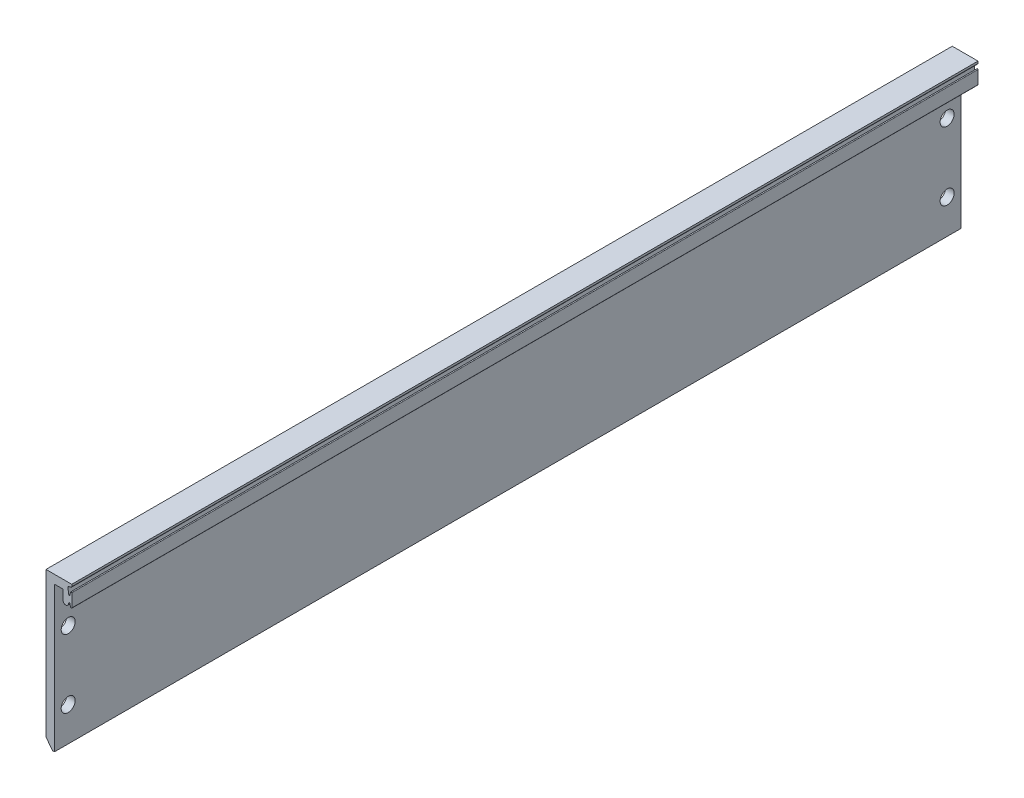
ISO-10303-21;
HEADER;
FILE_DESCRIPTION(('STEP AP214'),'2;1');
FILE_NAME('part.step','',(''),(''),'','','');
FILE_SCHEMA(('AUTOMOTIVE_DESIGN { 1 0 10303 214 1 1 1 1 }'));
ENDSEC;
DATA;
#1=APPLICATION_CONTEXT('core data for automotive mechanical design processes');
#2=APPLICATION_PROTOCOL_DEFINITION('international standard','automotive_design',2000,#1);
#3=PRODUCT_CONTEXT('',#1,'mechanical');
#4=PRODUCT('Part','Part','',(#3));
#5=PRODUCT_RELATED_PRODUCT_CATEGORY('part','',(#4));
#6=PRODUCT_DEFINITION_FORMATION('','',#4);
#7=PRODUCT_DEFINITION_CONTEXT('part definition',#1,'design');
#8=PRODUCT_DEFINITION('design','',#6,#7);
#9=PRODUCT_DEFINITION_SHAPE('','',#8);
#10=(LENGTH_UNIT() NAMED_UNIT(*) SI_UNIT(.MILLI.,.METRE.));
#11=(NAMED_UNIT(*) PLANE_ANGLE_UNIT() SI_UNIT($,.RADIAN.));
#12=(NAMED_UNIT(*) SI_UNIT($,.STERADIAN.) SOLID_ANGLE_UNIT());
#13=UNCERTAINTY_MEASURE_WITH_UNIT(LENGTH_MEASURE(1.E-05),#10,'distance_accuracy_value','');
#14=(GEOMETRIC_REPRESENTATION_CONTEXT(3) GLOBAL_UNCERTAINTY_ASSIGNED_CONTEXT((#13)) GLOBAL_UNIT_ASSIGNED_CONTEXT((#10,
#11,#12)) REPRESENTATION_CONTEXT('',''));
#15=CARTESIAN_POINT('',(0.,0.,0.));
#16=DIRECTION('',(0.,0.,1.));
#17=DIRECTION('',(1.,0.,0.));
#18=AXIS2_PLACEMENT_3D('',#15,#16,#17);
#19=CARTESIAN_POINT('',(540.829442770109,-3340.4171465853,132.675000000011));
#20=DIRECTION('',(-0.159823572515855,0.987145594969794,0.));
#21=DIRECTION('',(-0.987145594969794,-0.159823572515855,0.));
#22=AXIS2_PLACEMENT_3D('',#19,#20,#21);
#23=PLANE('',#22);
#24=DIRECTION('',(0.987145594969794,0.159823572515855,0.));
#25=VECTOR('',#24,1.);
#26=CARTESIAN_POINT('',(540.829442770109,-3340.4171465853,-132.674999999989));
#27=LINE('',#26,#25);
#28=CARTESIAN_POINT('',(2261.93990029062,-3061.76116775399,-132.67499999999));
#29=VERTEX_POINT('',#28);
#30=CARTESIAN_POINT('',(2262.48897943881,-3061.67226922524,-132.67499999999));
#31=VERTEX_POINT('',#30);
#32=EDGE_CURVE('E228',#29,#31,#27,.T.);
#33=ORIENTED_EDGE('',*,*,#32,.T.);
#34=DIRECTION('',(0.,0.,-1.));
#35=VECTOR('',#34,1.);
#36=CARTESIAN_POINT('',(2262.48897943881,-3061.67226922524,132.675000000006));
#37=LINE('',#36,#35);
#38=CARTESIAN_POINT('',(2262.48897943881,-3061.67226922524,132.675000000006));
#39=VERTEX_POINT('',#38);
#40=EDGE_CURVE('E13',#39,#31,#37,.T.);
#41=ORIENTED_EDGE('',*,*,#40,.F.);
#42=DIRECTION('',(0.987145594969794,0.159823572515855,0.));
#43=VECTOR('',#42,1.);
#44=CARTESIAN_POINT('',(540.829442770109,-3340.4171465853,132.675000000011));
#45=LINE('',#44,#43);
#46=CARTESIAN_POINT('',(2261.93990029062,-3061.76116775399,132.675000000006));
#47=VERTEX_POINT('',#46);
#48=EDGE_CURVE('E276',#47,#39,#45,.T.);
#49=ORIENTED_EDGE('',*,*,#48,.F.);
#50=DIRECTION('',(0.,0.,-1.));
#51=VECTOR('',#50,1.);
#52=CARTESIAN_POINT('',(2261.93990029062,-3061.76116775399,132.675000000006));
#53=LINE('',#52,#51);
#54=EDGE_CURVE('E70',#47,#29,#53,.T.);
#55=ORIENTED_EDGE('',*,*,#54,.T.);
#56=EDGE_LOOP('',(#33,#41,#49,#55));
#57=FACE_BOUND('',#56,.T.);
#58=ADVANCED_FACE('F52',(#57),#23,.F.);
#59=CARTESIAN_POINT('',(2262.44103236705,-3061.37612554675,132.675000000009));
#60=DIRECTION('',(0.,0.,-1.));
#61=DIRECTION('',(-1.,0.,0.));
#62=AXIS2_PLACEMENT_3D('',#59,#60,#61);
#63=CYLINDRICAL_SURFACE('',#62,0.300000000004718);
#64=CARTESIAN_POINT('',(2262.44103236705,-3061.37612554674,-132.67499999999));
#65=DIRECTION('',(0.,0.,1.));
#66=DIRECTION('',(1.,0.,0.));
#67=AXIS2_PLACEMENT_3D('',#64,#65,#66);
#68=CIRCLE('',#67,0.300000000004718);
#69=CARTESIAN_POINT('',(2262.74103236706,-3061.37612554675,-132.67499999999));
#70=VERTEX_POINT('',#69);
#71=EDGE_CURVE('E230',#31,#70,#68,.T.);
#72=ORIENTED_EDGE('',*,*,#71,.T.);
#73=DIRECTION('',(0.,0.,-1.));
#74=VECTOR('',#73,1.);
#75=CARTESIAN_POINT('',(2262.74103236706,-3061.37612554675,132.675000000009));
#76=LINE('',#75,#74);
#77=CARTESIAN_POINT('',(2262.74103236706,-3061.37612554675,132.675000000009));
#78=VERTEX_POINT('',#77);
#79=EDGE_CURVE('E61',#78,#70,#76,.T.);
#80=ORIENTED_EDGE('',*,*,#79,.F.);
#81=CARTESIAN_POINT('',(2262.44103236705,-3061.37612554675,132.675000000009));
#82=DIRECTION('',(0.,0.,1.));
#83=DIRECTION('',(1.,0.,0.));
#84=AXIS2_PLACEMENT_3D('',#81,#82,#83);
#85=CIRCLE('',#84,0.300000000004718);
#86=EDGE_CURVE('E147',#39,#78,#85,.T.);
#87=ORIENTED_EDGE('',*,*,#86,.F.);
#88=ORIENTED_EDGE('',*,*,#40,.T.);
#89=EDGE_LOOP('',(#72,#80,#87,#88));
#90=FACE_BOUND('',#89,.T.);
#91=ADVANCED_FACE('F402',(#90),#63,.T.);
#92=CARTESIAN_POINT('',(2262.74103237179,-3.49720252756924E-09,132.675000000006));
#93=DIRECTION('',(1.,-1.54555887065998E-12,0.));
#94=DIRECTION('',(1.54555887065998E-12,1.,0.));
#95=AXIS2_PLACEMENT_3D('',#92,#93,#94);
#96=PLANE('',#95);
#97=DIRECTION('',(-1.54555887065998E-12,-1.,0.));
#98=VECTOR('',#97,1.);
#99=CARTESIAN_POINT('',(2262.74103237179,-3.49720252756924E-09,-132.674999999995));
#100=LINE('',#99,#98);
#101=CARTESIAN_POINT('',(2262.74103236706,-3060.8014606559,-132.674999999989));
#102=VERTEX_POINT('',#101);
#103=EDGE_CURVE('E234',#102,#70,#100,.T.);
#104=ORIENTED_EDGE('',*,*,#103,.F.);
#105=DIRECTION('',(0.,0.,-1.));
#106=VECTOR('',#105,1.);
#107=CARTESIAN_POINT('',(2262.74103236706,-3060.80146065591,132.675000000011));
#108=LINE('',#107,#106);
#109=CARTESIAN_POINT('',(2262.74103236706,-3060.80146065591,132.675000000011));
#110=VERTEX_POINT('',#109);
#111=EDGE_CURVE('E320',#110,#102,#108,.T.);
#112=ORIENTED_EDGE('',*,*,#111,.F.);
#113=DIRECTION('',(-1.54555887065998E-12,-1.,0.));
#114=VECTOR('',#113,1.);
#115=CARTESIAN_POINT('',(2262.74103237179,-3.49720252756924E-09,132.675000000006));
#116=LINE('',#115,#114);
#117=EDGE_CURVE('E348',#110,#78,#116,.T.);
#118=ORIENTED_EDGE('',*,*,#117,.T.);
#119=ORIENTED_EDGE('',*,*,#79,.T.);
#120=EDGE_LOOP('',(#104,#112,#118,#119));
#121=FACE_BOUND('',#120,.T.);
#122=ADVANCED_FACE('F406',(#121),#96,.T.);
#123=CARTESIAN_POINT('',(1.85629289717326E-10,-3060.80146065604,132.675000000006));
#124=DIRECTION('',(0.,-1.,0.));
#125=DIRECTION('',(1.,0.,0.));
#126=AXIS2_PLACEMENT_3D('',#123,#124,#125);
#127=PLANE('',#126);
#128=DIRECTION('',(-1.,0.,0.));
#129=VECTOR('',#128,1.);
#130=CARTESIAN_POINT('',(1.85629289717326E-10,-3060.80146065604,-132.674999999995));
#131=LINE('',#130,#129);
#132=CARTESIAN_POINT('',(2255.20103236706,-3060.8014606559,-132.674999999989));
#133=VERTEX_POINT('',#132);
#134=EDGE_CURVE('E237',#102,#133,#131,.T.);
#135=ORIENTED_EDGE('',*,*,#134,.T.);
#136=DIRECTION('',(0.,0.,-1.));
#137=VECTOR('',#136,1.);
#138=CARTESIAN_POINT('',(2255.20103236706,-3060.8014606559,132.675000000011));
#139=LINE('',#138,#137);
#140=CARTESIAN_POINT('',(2255.20103236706,-3060.8014606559,132.675000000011));
#141=VERTEX_POINT('',#140);
#142=EDGE_CURVE('E317',#141,#133,#139,.T.);
#143=ORIENTED_EDGE('',*,*,#142,.F.);
#144=DIRECTION('',(-1.,0.,0.));
#145=VECTOR('',#144,1.);
#146=CARTESIAN_POINT('',(1.85629289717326E-10,-3060.80146065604,132.675000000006));
#147=LINE('',#146,#145);
#148=EDGE_CURVE('E351',#110,#141,#147,.T.);
#149=ORIENTED_EDGE('',*,*,#148,.F.);
#150=ORIENTED_EDGE('',*,*,#111,.T.);
#151=EDGE_LOOP('',(#135,#143,#149,#150));
#152=FACE_BOUND('',#151,.T.);
#153=ADVANCED_FACE('F418',(#152),#127,.F.);
#154=CARTESIAN_POINT('',(2255.20103236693,9.70334923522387E-11,132.675000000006));
#155=DIRECTION('',(1.,0.,0.));
#156=DIRECTION('',(0.,1.,0.));
#157=AXIS2_PLACEMENT_3D('',#154,#155,#156);
#158=PLANE('',#157);
#159=CARTESIAN_POINT('',(2255.20103236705,-3075.8014606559,128.675000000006));
#160=DIRECTION('',(-1.,0.,0.));
#161=DIRECTION('',(0.,1.,0.));
#162=AXIS2_PLACEMENT_3D('',#159,#160,#161);
#163=CIRCLE('',#162,2.04999999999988);
#164=CARTESIAN_POINT('',(2255.20103236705,-3073.75146065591,128.675000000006));
#165=VERTEX_POINT('',#164);
#166=EDGE_CURVE('E341',#165,#165,#163,.T.);
#167=ORIENTED_EDGE('',*,*,#166,.F.);
#168=EDGE_LOOP('',(#167));
#169=FACE_BOUND('',#168,.T.);
#170=CARTESIAN_POINT('',(2255.20103236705,-3095.8014606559,128.675000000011));
#171=DIRECTION('',(-1.,0.,0.));
#172=DIRECTION('',(0.,1.,0.));
#173=AXIS2_PLACEMENT_3D('',#170,#171,#172);
#174=CIRCLE('',#173,2.05000000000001);
#175=CARTESIAN_POINT('',(2255.20103236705,-3093.7514606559,128.675000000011));
#176=VERTEX_POINT('',#175);
#177=EDGE_CURVE('E331',#176,#176,#174,.T.);
#178=ORIENTED_EDGE('',*,*,#177,.F.);
#179=EDGE_LOOP('',(#178));
#180=FACE_BOUND('',#179,.T.);
#181=CARTESIAN_POINT('',(2255.20103236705,-3095.8014606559,-128.674999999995));
#182=DIRECTION('',(-1.,0.,0.));
#183=DIRECTION('',(0.,-1.,0.));
#184=AXIS2_PLACEMENT_3D('',#181,#182,#183);
#185=CIRCLE('',#184,2.05000000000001);
#186=CARTESIAN_POINT('',(2255.20103236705,-3097.8514606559,-128.674999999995));
#187=VERTEX_POINT('',#186);
#188=EDGE_CURVE('E328',#187,#187,#185,.T.);
#189=ORIENTED_EDGE('',*,*,#188,.F.);
#190=EDGE_LOOP('',(#189));
#191=FACE_BOUND('',#190,.T.);
#192=CARTESIAN_POINT('',(2255.20103236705,-3075.80146065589,-128.674999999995));
#193=DIRECTION('',(-1.,0.,0.));
#194=DIRECTION('',(0.,-1.,0.));
#195=AXIS2_PLACEMENT_3D('',#192,#193,#194);
#196=CIRCLE('',#195,2.04999999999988);
#197=CARTESIAN_POINT('',(2255.20103236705,-3077.85146065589,-128.674999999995));
#198=VERTEX_POINT('',#197);
#199=EDGE_CURVE('E325',#198,#198,#196,.T.);
#200=ORIENTED_EDGE('',*,*,#199,.F.);
#201=EDGE_LOOP('',(#200));
#202=FACE_BOUND('',#201,.T.);
#203=DIRECTION('',(0.,-1.,0.));
#204=VECTOR('',#203,1.);
#205=CARTESIAN_POINT('',(2255.20103236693,9.43689570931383E-11,-132.674999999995));
#206=LINE('',#205,#204);
#207=CARTESIAN_POINT('',(2255.20103236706,-3103.3014606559,-132.674999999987));
#208=VERTEX_POINT('',#207);
#209=EDGE_CURVE('E239',#133,#208,#206,.T.);
#210=ORIENTED_EDGE('',*,*,#209,.T.);
#211=DIRECTION('',(0.,0.,-1.));
#212=VECTOR('',#211,1.);
#213=CARTESIAN_POINT('',(2255.20103236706,-3103.3014606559,132.675000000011));
#214=LINE('',#213,#212);
#215=CARTESIAN_POINT('',(2255.20103236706,-3103.3014606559,132.675000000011));
#216=VERTEX_POINT('',#215);
#217=EDGE_CURVE('E314',#216,#208,#214,.T.);
#218=ORIENTED_EDGE('',*,*,#217,.F.);
#219=DIRECTION('',(0.,-1.,0.));
#220=VECTOR('',#219,1.);
#221=CARTESIAN_POINT('',(2255.20103236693,9.70334923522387E-11,132.675000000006));
#222=LINE('',#221,#220);
#223=EDGE_CURVE('E353',#141,#216,#222,.T.);
#224=ORIENTED_EDGE('',*,*,#223,.F.);
#225=ORIENTED_EDGE('',*,*,#142,.T.);
#226=EDGE_LOOP('',(#210,#218,#224,#225));
#227=FACE_BOUND('',#226,.T.);
#228=ADVANCED_FACE('F420',(#169,#180,#191,#202,#227),#158,.F.);
#229=CARTESIAN_POINT('',(-65.4843291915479,-49.7680901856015,132.675000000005));
#230=DIRECTION('',(0.796162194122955,0.605083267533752,0.));
#231=DIRECTION('',(-0.605083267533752,0.796162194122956,0.));
#232=AXIS2_PLACEMENT_3D('',#229,#230,#231);
#233=PLANE('',#232);
#234=DIRECTION('',(0.605083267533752,-0.796162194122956,0.));
#235=VECTOR('',#234,1.);
#236=CARTESIAN_POINT('',(-65.4843291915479,-49.7680901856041,-132.674999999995));
#237=LINE('',#236,#235);
#238=CARTESIAN_POINT('',(2257.10103236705,-3105.8014606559,-132.674999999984));
#239=VERTEX_POINT('',#238);
#240=EDGE_CURVE('E241',#208,#239,#237,.T.);
#241=ORIENTED_EDGE('',*,*,#240,.T.);
#242=DIRECTION('',(0.,0.,-1.));
#243=VECTOR('',#242,1.);
#244=CARTESIAN_POINT('',(2257.10103236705,-3105.80146065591,132.675000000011));
#245=LINE('',#244,#243);
#246=CARTESIAN_POINT('',(2257.10103236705,-3105.80146065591,132.675000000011));
#247=VERTEX_POINT('',#246);
#248=EDGE_CURVE('E311',#247,#239,#245,.T.);
#249=ORIENTED_EDGE('',*,*,#248,.F.);
#250=DIRECTION('',(0.605083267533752,-0.796162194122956,0.));
#251=VECTOR('',#250,1.);
#252=CARTESIAN_POINT('',(-65.4843291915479,-49.7680901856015,132.675000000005));
#253=LINE('',#252,#251);
#254=EDGE_CURVE('E355',#216,#247,#253,.T.);
#255=ORIENTED_EDGE('',*,*,#254,.F.);
#256=ORIENTED_EDGE('',*,*,#217,.T.);
#257=EDGE_LOOP('',(#241,#249,#255,#256));
#258=FACE_BOUND('',#257,.T.);
#259=ADVANCED_FACE('F425',(#258),#233,.F.);
#260=CARTESIAN_POINT('',(0.,-3105.8014606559,132.675000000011));
#261=DIRECTION('',(0.,1.,0.));
#262=DIRECTION('',(0.,0.,1.));
#263=AXIS2_PLACEMENT_3D('',#260,#261,#262);
#264=PLANE('',#263);
#265=DIRECTION('',(1.,0.,0.));
#266=VECTOR('',#265,1.);
#267=CARTESIAN_POINT('',(0.,-3105.8014606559,-132.674999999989));
#268=LINE('',#267,#266);
#269=CARTESIAN_POINT('',(2257.70103236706,-3105.80146065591,-132.674999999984));
#270=VERTEX_POINT('',#269);
#271=EDGE_CURVE('E243',#239,#270,#268,.T.);
#272=ORIENTED_EDGE('',*,*,#271,.T.);
#273=DIRECTION('',(0.,0.,-1.));
#274=VECTOR('',#273,1.);
#275=CARTESIAN_POINT('',(2257.70103236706,-3105.80146065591,132.675000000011));
#276=LINE('',#275,#274);
#277=CARTESIAN_POINT('',(2257.70103236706,-3105.80146065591,132.675000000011));
#278=VERTEX_POINT('',#277);
#279=EDGE_CURVE('E308',#278,#270,#276,.T.);
#280=ORIENTED_EDGE('',*,*,#279,.F.);
#281=DIRECTION('',(1.,0.,0.));
#282=VECTOR('',#281,1.);
#283=CARTESIAN_POINT('',(0.,-3105.8014606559,132.675000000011));
#284=LINE('',#283,#282);
#285=EDGE_CURVE('E357',#247,#278,#284,.T.);
#286=ORIENTED_EDGE('',*,*,#285,.F.);
#287=ORIENTED_EDGE('',*,*,#248,.T.);
#288=EDGE_LOOP('',(#272,#280,#286,#287));
#289=FACE_BOUND('',#288,.T.);
#290=ADVANCED_FACE('F431',(#289),#264,.F.);
#291=CARTESIAN_POINT('',(2257.70103236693,9.43689570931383E-11,132.675000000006));
#292=DIRECTION('',(-1.,0.,0.));
#293=DIRECTION('',(0.,-1.,0.));
#294=AXIS2_PLACEMENT_3D('',#291,#292,#293);
#295=PLANE('',#294);
#296=CARTESIAN_POINT('',(2257.70103236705,-3075.80146065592,128.675000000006));
#297=DIRECTION('',(-1.,0.,0.));
#298=DIRECTION('',(0.,-1.,0.));
#299=AXIS2_PLACEMENT_3D('',#296,#297,#298);
#300=CIRCLE('',#299,2.04999999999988);
#301=CARTESIAN_POINT('',(2257.70103236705,-3077.85146065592,128.675000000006));
#302=VERTEX_POINT('',#301);
#303=EDGE_CURVE('E55',#302,#302,#300,.T.);
#304=ORIENTED_EDGE('',*,*,#303,.T.);
#305=EDGE_LOOP('',(#304));
#306=FACE_BOUND('',#305,.T.);
#307=CARTESIAN_POINT('',(2257.70103236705,-3095.80146065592,128.675000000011));
#308=DIRECTION('',(-1.,0.,0.));
#309=DIRECTION('',(0.,-1.,0.));
#310=AXIS2_PLACEMENT_3D('',#307,#308,#309);
#311=CIRCLE('',#310,2.05000000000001);
#312=CARTESIAN_POINT('',(2257.70103236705,-3097.85146065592,128.675000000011));
#313=VERTEX_POINT('',#312);
#314=EDGE_CURVE('E329',#313,#313,#311,.T.);
#315=ORIENTED_EDGE('',*,*,#314,.T.);
#316=EDGE_LOOP('',(#315));
#317=FACE_BOUND('',#316,.T.);
#318=CARTESIAN_POINT('',(2257.70103236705,-3095.80146065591,-128.674999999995));
#319=DIRECTION('',(-1.,0.,0.));
#320=DIRECTION('',(0.,-1.,0.));
#321=AXIS2_PLACEMENT_3D('',#318,#319,#320);
#322=CIRCLE('',#321,2.05000000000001);
#323=CARTESIAN_POINT('',(2257.70103236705,-3097.85146065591,-128.674999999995));
#324=VERTEX_POINT('',#323);
#325=EDGE_CURVE('E326',#324,#324,#322,.T.);
#326=ORIENTED_EDGE('',*,*,#325,.T.);
#327=EDGE_LOOP('',(#326));
#328=FACE_BOUND('',#327,.T.);
#329=CARTESIAN_POINT('',(2257.70103236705,-3075.80146065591,-128.674999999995));
#330=DIRECTION('',(-1.,0.,0.));
#331=DIRECTION('',(0.,-1.,0.));
#332=AXIS2_PLACEMENT_3D('',#329,#330,#331);
#333=CIRCLE('',#332,2.04999999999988);
#334=CARTESIAN_POINT('',(2257.70103236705,-3077.85146065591,-128.674999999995));
#335=VERTEX_POINT('',#334);
#336=EDGE_CURVE('E231',#335,#335,#333,.T.);
#337=ORIENTED_EDGE('',*,*,#336,.T.);
#338=EDGE_LOOP('',(#337));
#339=FACE_BOUND('',#338,.T.);
#340=DIRECTION('',(0.,1.,0.));
#341=VECTOR('',#340,1.);
#342=CARTESIAN_POINT('',(2257.70103236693,9.43689570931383E-11,-132.674999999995));
#343=LINE('',#342,#341);
#344=CARTESIAN_POINT('',(2257.70103236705,-3063.30146065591,-132.674999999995));
#345=VERTEX_POINT('',#344);
#346=EDGE_CURVE('E245',#270,#345,#343,.T.);
#347=ORIENTED_EDGE('',*,*,#346,.T.);
#348=DIRECTION('',(0.,0.,-1.));
#349=VECTOR('',#348,1.);
#350=CARTESIAN_POINT('',(2257.70103236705,-3063.30146065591,132.67500000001));
#351=LINE('',#350,#349);
#352=CARTESIAN_POINT('',(2257.70103236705,-3063.30146065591,132.67500000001));
#353=VERTEX_POINT('',#352);
#354=EDGE_CURVE('E305',#353,#345,#351,.T.);
#355=ORIENTED_EDGE('',*,*,#354,.F.);
#356=DIRECTION('',(0.,1.,0.));
#357=VECTOR('',#356,1.);
#358=CARTESIAN_POINT('',(2257.70103236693,9.43689570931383E-11,132.675000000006));
#359=LINE('',#358,#357);
#360=EDGE_CURVE('E359',#278,#353,#359,.T.);
#361=ORIENTED_EDGE('',*,*,#360,.F.);
#362=ORIENTED_EDGE('',*,*,#279,.T.);
#363=EDGE_LOOP('',(#347,#355,#361,#362));
#364=FACE_BOUND('',#363,.T.);
#365=ADVANCED_FACE('F435',(#306,#317,#328,#339,#364),#295,.F.);
#366=CARTESIAN_POINT('',(-5.44453371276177E-10,-3063.3014606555,132.675));
#367=DIRECTION('',(1.77635683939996E-13,1.,0.));
#368=DIRECTION('',(-1.,1.77635683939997E-13,0.));
#369=AXIS2_PLACEMENT_3D('',#366,#367,#368);
#370=PLANE('',#369);
#371=DIRECTION('',(1.,-1.77635683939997E-13,0.));
#372=VECTOR('',#371,1.);
#373=CARTESIAN_POINT('',(-5.44453371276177E-10,-3063.3014606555,-132.674999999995));
#374=LINE('',#373,#372);
#375=CARTESIAN_POINT('',(2260.20103236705,-3063.3014606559,-132.674999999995));
#376=VERTEX_POINT('',#375);
#377=EDGE_CURVE('E247',#345,#376,#374,.T.);
#378=ORIENTED_EDGE('',*,*,#377,.T.);
#379=DIRECTION('',(0.,0.,-1.));
#380=VECTOR('',#379,1.);
#381=CARTESIAN_POINT('',(2260.20103236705,-3063.3014606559,132.67500000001));
#382=LINE('',#381,#380);
#383=CARTESIAN_POINT('',(2260.20103236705,-3063.3014606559,132.67500000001));
#384=VERTEX_POINT('',#383);
#385=EDGE_CURVE('E302',#384,#376,#382,.T.);
#386=ORIENTED_EDGE('',*,*,#385,.F.);
#387=DIRECTION('',(1.,-1.77635683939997E-13,0.));
#388=VECTOR('',#387,1.);
#389=CARTESIAN_POINT('',(-5.44453371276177E-10,-3063.3014606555,132.675));
#390=LINE('',#389,#388);
#391=EDGE_CURVE('E361',#353,#384,#390,.T.);
#392=ORIENTED_EDGE('',*,*,#391,.F.);
#393=ORIENTED_EDGE('',*,*,#354,.T.);
#394=EDGE_LOOP('',(#378,#386,#392,#393));
#395=FACE_BOUND('',#394,.T.);
#396=ADVANCED_FACE('F440',(#395),#370,.F.);
#397=CARTESIAN_POINT('',(2260.2010323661,7.02993219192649E-10,132.675000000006));
#398=DIRECTION('',(1.,3.09870404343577E-13,0.));
#399=DIRECTION('',(-3.09870404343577E-13,1.,0.));
#400=AXIS2_PLACEMENT_3D('',#397,#398,#399);
#401=PLANE('',#400);
#402=DIRECTION('',(3.09870404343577E-13,-1.,0.));
#403=VECTOR('',#402,1.);
#404=CARTESIAN_POINT('',(2260.2010323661,7.00328683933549E-10,-132.674999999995));
#405=LINE('',#404,#403);
#406=CARTESIAN_POINT('',(2260.20103236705,-3066.16775058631,-132.674999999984));
#407=VERTEX_POINT('',#406);
#408=EDGE_CURVE('E249',#376,#407,#405,.T.);
#409=ORIENTED_EDGE('',*,*,#408,.T.);
#410=DIRECTION('',(0.,0.,-1.));
#411=VECTOR('',#410,1.);
#412=CARTESIAN_POINT('',(2260.20103236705,-3066.16775058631,132.675000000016));
#413=LINE('',#412,#411);
#414=CARTESIAN_POINT('',(2260.20103236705,-3066.16775058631,132.675000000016));
#415=VERTEX_POINT('',#414);
#416=EDGE_CURVE('E299',#415,#407,#413,.T.);
#417=ORIENTED_EDGE('',*,*,#416,.F.);
#418=DIRECTION('',(3.09870404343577E-13,-1.,0.));
#419=VECTOR('',#418,1.);
#420=CARTESIAN_POINT('',(2260.2010323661,7.02993219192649E-10,132.675000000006));
#421=LINE('',#420,#419);
#422=EDGE_CURVE('E363',#384,#415,#421,.T.);
#423=ORIENTED_EDGE('',*,*,#422,.F.);
#424=ORIENTED_EDGE('',*,*,#385,.T.);
#425=EDGE_LOOP('',(#409,#417,#423,#424));
#426=FACE_BOUND('',#425,.T.);
#427=ADVANCED_FACE('F446',(#426),#401,.F.);
#428=CARTESIAN_POINT('',(2260.98474243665,-3066.16775058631,132.675000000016));
#429=DIRECTION('',(0.,0.,-1.));
#430=DIRECTION('',(-1.,0.,0.));
#431=AXIS2_PLACEMENT_3D('',#428,#429,#430);
#432=CYLINDRICAL_SURFACE('',#431,0.783710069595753);
#433=CARTESIAN_POINT('',(2260.98474243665,-3066.16775058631,-132.674999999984));
#434=DIRECTION('',(0.,0.,1.));
#435=DIRECTION('',(1.,0.,0.));
#436=AXIS2_PLACEMENT_3D('',#433,#434,#435);
#437=CIRCLE('',#436,0.783710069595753);
#438=CARTESIAN_POINT('',(2261.74118201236,-3066.37269116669,-132.674999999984));
#439=VERTEX_POINT('',#438);
#440=EDGE_CURVE('E251',#407,#439,#437,.T.);
#441=ORIENTED_EDGE('',*,*,#440,.T.);
#442=DIRECTION('',(0.,0.,-1.));
#443=VECTOR('',#442,1.);
#444=CARTESIAN_POINT('',(2261.74118201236,-3066.37269116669,132.675000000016));
#445=LINE('',#444,#443);
#446=CARTESIAN_POINT('',(2261.74118201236,-3066.37269116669,132.675000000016));
#447=VERTEX_POINT('',#446);
#448=EDGE_CURVE('E296',#447,#439,#445,.T.);
#449=ORIENTED_EDGE('',*,*,#448,.F.);
#450=CARTESIAN_POINT('',(2260.98474243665,-3066.16775058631,132.675000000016));
#451=DIRECTION('',(0.,0.,1.));
#452=DIRECTION('',(1.,0.,0.));
#453=AXIS2_PLACEMENT_3D('',#450,#451,#452);
#454=CIRCLE('',#453,0.783710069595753);
#455=EDGE_CURVE('E365',#415,#447,#454,.T.);
#456=ORIENTED_EDGE('',*,*,#455,.F.);
#457=ORIENTED_EDGE('',*,*,#416,.T.);
#458=EDGE_LOOP('',(#441,#449,#456,#457));
#459=FACE_BOUND('',#458,.T.);
#460=ADVANCED_FACE('F450',(#459),#432,.T.);
#461=CARTESIAN_POINT('',(2881.03366264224,-780.552379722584,132.675000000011));
#462=DIRECTION('',(-0.965203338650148,0.261500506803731,0.));
#463=DIRECTION('',(-0.261500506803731,-0.965203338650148,0.));
#464=AXIS2_PLACEMENT_3D('',#461,#462,#463);
#465=PLANE('',#464);
#466=DIRECTION('',(0.261500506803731,0.965203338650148,0.));
#467=VECTOR('',#466,1.);
#468=CARTESIAN_POINT('',(2881.03366264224,-780.552379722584,-132.674999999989));
#469=LINE('',#468,#467);
#470=CARTESIAN_POINT('',(2261.88625186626,-3065.83723557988,-132.674999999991));
#471=VERTEX_POINT('',#470);
#472=EDGE_CURVE('E253',#439,#471,#469,.T.);
#473=ORIENTED_EDGE('',*,*,#472,.T.);
#474=DIRECTION('',(0.,0.,-1.));
#475=VECTOR('',#474,1.);
#476=CARTESIAN_POINT('',(2261.88625186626,-3065.83723557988,132.675000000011));
#477=LINE('',#476,#475);
#478=CARTESIAN_POINT('',(2261.88625186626,-3065.83723557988,132.675000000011));
#479=VERTEX_POINT('',#478);
#480=EDGE_CURVE('E294',#479,#471,#477,.T.);
#481=ORIENTED_EDGE('',*,*,#480,.F.);
#482=DIRECTION('',(0.261500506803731,0.965203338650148,0.));
#483=VECTOR('',#482,1.);
#484=CARTESIAN_POINT('',(2881.03366264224,-780.552379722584,132.675000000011));
#485=LINE('',#484,#483);
#486=EDGE_CURVE('E367',#447,#479,#485,.T.);
#487=ORIENTED_EDGE('',*,*,#486,.F.);
#488=ORIENTED_EDGE('',*,*,#448,.T.);
#489=EDGE_LOOP('',(#473,#481,#487,#488));
#490=FACE_BOUND('',#489,.T.);
#491=ADVANCED_FACE('F455',(#490),#465,.F.);
#492=CARTESIAN_POINT('',(2262.03103236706,-3065.8764606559,132.675000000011));
#493=DIRECTION('',(0.,0.,-1.));
#494=DIRECTION('',(-1.,0.,0.));
#495=AXIS2_PLACEMENT_3D('',#492,#493,#494);
#496=CYLINDRICAL_SURFACE('',#495,0.149999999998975);
#497=CARTESIAN_POINT('',(2262.03103236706,-3065.8764606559,-132.674999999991));
#498=DIRECTION('',(0.,0.,1.));
#499=DIRECTION('',(1.,0.,0.));
#500=AXIS2_PLACEMENT_3D('',#497,#498,#499);
#501=CIRCLE('',#500,0.149999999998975);
#502=CARTESIAN_POINT('',(2262.1766483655,-3065.84046091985,-132.674999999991));
#503=VERTEX_POINT('',#502);
#504=EDGE_CURVE('E256',#503,#471,#501,.T.);
#505=ORIENTED_EDGE('',*,*,#504,.F.);
#506=DIRECTION('',(0.,0.,-1.));
#507=VECTOR('',#506,1.);
#508=CARTESIAN_POINT('',(2262.17664836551,-3065.84046091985,132.675000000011));
#509=LINE('',#508,#507);
#510=CARTESIAN_POINT('',(2262.17664836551,-3065.84046091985,132.675000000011));
#511=VERTEX_POINT('',#510);
#512=EDGE_CURVE('E292',#511,#503,#509,.T.);
#513=ORIENTED_EDGE('',*,*,#512,.F.);
#514=CARTESIAN_POINT('',(2262.03103236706,-3065.8764606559,132.675000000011));
#515=DIRECTION('',(0.,0.,1.));
#516=DIRECTION('',(1.,0.,0.));
#517=AXIS2_PLACEMENT_3D('',#514,#515,#516);
#518=CIRCLE('',#517,0.149999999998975);
#519=EDGE_CURVE('E369',#511,#479,#518,.T.);
#520=ORIENTED_EDGE('',*,*,#519,.T.);
#521=ORIENTED_EDGE('',*,*,#480,.T.);
#522=EDGE_LOOP('',(#505,#513,#520,#521));
#523=FACE_BOUND('',#522,.T.);
#524=ADVANCED_FACE('F461',(#523),#496,.F.);
#525=CARTESIAN_POINT('',(1417.58574950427,350.460892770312,132.675000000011));
#526=DIRECTION('',(0.970773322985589,0.239998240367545,0.));
#527=DIRECTION('',(-0.239998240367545,0.970773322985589,0.));
#528=AXIS2_PLACEMENT_3D('',#525,#526,#527);
#529=PLANE('',#528);
#530=DIRECTION('',(0.239998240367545,-0.970773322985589,0.));
#531=VECTOR('',#530,1.);
#532=CARTESIAN_POINT('',(1417.58574950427,350.460892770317,-132.674999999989));
#533=LINE('',#532,#531);
#534=CARTESIAN_POINT('',(2262.42078170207,-3066.82796036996,-132.674999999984));
#535=VERTEX_POINT('',#534);
#536=EDGE_CURVE('E259',#503,#535,#533,.T.);
#537=ORIENTED_EDGE('',*,*,#536,.T.);
#538=DIRECTION('',(0.,0.,-1.));
#539=VECTOR('',#538,1.);
#540=CARTESIAN_POINT('',(2262.42078170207,-3066.82796036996,132.675000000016));
#541=LINE('',#540,#539);
#542=CARTESIAN_POINT('',(2262.42078170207,-3066.82796036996,132.675000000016));
#543=VERTEX_POINT('',#542);
#544=EDGE_CURVE('E289',#543,#535,#541,.T.);
#545=ORIENTED_EDGE('',*,*,#544,.F.);
#546=DIRECTION('',(0.239998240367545,-0.970773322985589,0.));
#547=VECTOR('',#546,1.);
#548=CARTESIAN_POINT('',(1417.58574950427,350.460892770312,132.675000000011));
#549=LINE('',#548,#547);
#550=EDGE_CURVE('E372',#511,#543,#549,.T.);
#551=ORIENTED_EDGE('',*,*,#550,.F.);
#552=ORIENTED_EDGE('',*,*,#512,.T.);
#553=EDGE_LOOP('',(#537,#545,#551,#552));
#554=FACE_BOUND('',#553,.T.);
#555=ADVANCED_FACE('F464',(#554),#529,.F.);
#556=CARTESIAN_POINT('',(2262.57853236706,-3066.7889606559,132.675000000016));
#557=DIRECTION('',(0.,0.,-1.));
#558=DIRECTION('',(-1.,0.,0.));
#559=AXIS2_PLACEMENT_3D('',#556,#557,#558);
#560=CYLINDRICAL_SURFACE('',#559,0.162500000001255);
#561=CARTESIAN_POINT('',(2262.57853236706,-3066.7889606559,-132.674999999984));
#562=DIRECTION('',(0.,0.,1.));
#563=DIRECTION('',(1.,0.,0.));
#564=AXIS2_PLACEMENT_3D('',#561,#562,#563);
#565=CIRCLE('',#564,0.162500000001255);
#566=CARTESIAN_POINT('',(2262.74103236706,-3066.7889606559,-132.674999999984));
#567=VERTEX_POINT('',#566);
#568=EDGE_CURVE('E261',#535,#567,#565,.T.);
#569=ORIENTED_EDGE('',*,*,#568,.T.);
#570=DIRECTION('',(0.,0.,-1.));
#571=VECTOR('',#570,1.);
#572=CARTESIAN_POINT('',(2262.74103236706,-3066.78896065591,132.675000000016));
#573=LINE('',#572,#571);
#574=CARTESIAN_POINT('',(2262.74103236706,-3066.78896065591,132.675000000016));
#575=VERTEX_POINT('',#574);
#576=EDGE_CURVE('E286',#575,#567,#573,.T.);
#577=ORIENTED_EDGE('',*,*,#576,.F.);
#578=CARTESIAN_POINT('',(2262.57853236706,-3066.7889606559,132.675000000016));
#579=DIRECTION('',(0.,0.,1.));
#580=DIRECTION('',(1.,0.,0.));
#581=AXIS2_PLACEMENT_3D('',#578,#579,#580);
#582=CIRCLE('',#581,0.162500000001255);
#583=EDGE_CURVE('E374',#543,#575,#582,.T.);
#584=ORIENTED_EDGE('',*,*,#583,.F.);
#585=ORIENTED_EDGE('',*,*,#544,.T.);
#586=EDGE_LOOP('',(#569,#577,#584,#585));
#587=FACE_BOUND('',#586,.T.);
#588=ADVANCED_FACE('F469',(#587),#560,.T.);
#589=CARTESIAN_POINT('',(2262.74103236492,1.5762946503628E-09,132.675000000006));
#590=DIRECTION('',(-1.,-6.96610525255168E-13,0.));
#591=DIRECTION('',(6.96610525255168E-13,-1.,0.));
#592=AXIS2_PLACEMENT_3D('',#589,#590,#591);
#593=PLANE('',#592);
#594=DIRECTION('',(-6.96610525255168E-13,1.,0.));
#595=VECTOR('',#594,1.);
#596=CARTESIAN_POINT('',(2262.74103236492,1.57607260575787E-09,-132.674999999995));
#597=LINE('',#596,#595);
#598=CARTESIAN_POINT('',(2262.74103236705,-3062.9639606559,-132.674999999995));
#599=VERTEX_POINT('',#598);
#600=EDGE_CURVE('E263',#567,#599,#597,.T.);
#601=ORIENTED_EDGE('',*,*,#600,.T.);
#602=DIRECTION('',(0.,0.,-1.));
#603=VECTOR('',#602,1.);
#604=CARTESIAN_POINT('',(2262.74103236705,-3062.96396065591,132.675000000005));
#605=LINE('',#604,#603);
#606=CARTESIAN_POINT('',(2262.74103236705,-3062.96396065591,132.675000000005));
#607=VERTEX_POINT('',#606);
#608=EDGE_CURVE('E283',#607,#599,#605,.T.);
#609=ORIENTED_EDGE('',*,*,#608,.F.);
#610=DIRECTION('',(-6.96610525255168E-13,1.,0.));
#611=VECTOR('',#610,1.);
#612=CARTESIAN_POINT('',(2262.74103236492,1.5762946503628E-09,132.675000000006));
#613=LINE('',#612,#611);
#614=EDGE_CURVE('E376',#575,#607,#613,.T.);
#615=ORIENTED_EDGE('',*,*,#614,.F.);
#616=ORIENTED_EDGE('',*,*,#576,.T.);
#617=EDGE_LOOP('',(#601,#609,#615,#616));
#618=FACE_BOUND('',#617,.T.);
#619=ADVANCED_FACE('F472',(#618),#593,.F.);
#620=CARTESIAN_POINT('',(2262.57853236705,-3062.96396065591,132.675000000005));
#621=DIRECTION('',(0.,0.,-1.));
#622=DIRECTION('',(-1.,0.,0.));
#623=AXIS2_PLACEMENT_3D('',#620,#621,#622);
#624=CYLINDRICAL_SURFACE('',#623,0.162499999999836);
#625=CARTESIAN_POINT('',(2262.57853236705,-3062.96396065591,-132.674999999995));
#626=DIRECTION('',(0.,0.,1.));
#627=DIRECTION('',(1.,0.,0.));
#628=AXIS2_PLACEMENT_3D('',#625,#626,#627);
#629=CIRCLE('',#628,0.162499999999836);
#630=CARTESIAN_POINT('',(2262.42078170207,-3062.92496094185,-132.674999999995));
#631=VERTEX_POINT('',#630);
#632=EDGE_CURVE('E265',#599,#631,#629,.T.);
#633=ORIENTED_EDGE('',*,*,#632,.T.);
#634=DIRECTION('',(0.,0.,-1.));
#635=VECTOR('',#634,1.);
#636=CARTESIAN_POINT('',(2262.42078170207,-3062.92496094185,132.675000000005));
#637=LINE('',#636,#635);
#638=CARTESIAN_POINT('',(2262.42078170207,-3062.92496094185,132.675000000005));
#639=VERTEX_POINT('',#638);
#640=EDGE_CURVE('E280',#639,#631,#637,.T.);
#641=ORIENTED_EDGE('',*,*,#640,.F.);
#642=CARTESIAN_POINT('',(2262.57853236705,-3062.96396065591,132.675000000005));
#643=DIRECTION('',(0.,0.,1.));
#644=DIRECTION('',(1.,0.,0.));
#645=AXIS2_PLACEMENT_3D('',#642,#643,#644);
#646=CIRCLE('',#645,0.162499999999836);
#647=EDGE_CURVE('E378',#607,#639,#646,.T.);
#648=ORIENTED_EDGE('',*,*,#647,.F.);
#649=ORIENTED_EDGE('',*,*,#608,.T.);
#650=EDGE_LOOP('',(#633,#641,#648,#649));
#651=FACE_BOUND('',#650,.T.);
#652=ADVANCED_FACE('F384',(#651),#624,.T.);
#653=CARTESIAN_POINT('',(2845.71942563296,-703.529483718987,132.675000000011));
#654=DIRECTION('',(0.97077332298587,-0.239998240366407,0.));
#655=DIRECTION('',(0.239998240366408,0.97077332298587,0.));
#656=AXIS2_PLACEMENT_3D('',#653,#654,#655);
#657=PLANE('',#656);
#658=DIRECTION('',(-0.239998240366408,-0.97077332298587,0.));
#659=VECTOR('',#658,1.);
#660=CARTESIAN_POINT('',(2845.71942563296,-703.529483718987,-132.674999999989));
#661=LINE('',#660,#659);
#662=CARTESIAN_POINT('',(2262.1766483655,-3063.91246039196,-132.67499999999));
#663=VERTEX_POINT('',#662);
#664=EDGE_CURVE('E267',#631,#663,#661,.T.);
#665=ORIENTED_EDGE('',*,*,#664,.T.);
#666=DIRECTION('',(0.,0.,-1.));
#667=VECTOR('',#666,1.);
#668=CARTESIAN_POINT('',(2262.1766483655,-3063.91246039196,132.675000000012));
#669=LINE('',#668,#667);
#670=CARTESIAN_POINT('',(2262.1766483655,-3063.91246039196,132.675000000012));
#671=VERTEX_POINT('',#670);
#672=EDGE_CURVE('E211',#671,#663,#669,.T.);
#673=ORIENTED_EDGE('',*,*,#672,.F.);
#674=DIRECTION('',(-0.239998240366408,-0.97077332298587,0.));
#675=VECTOR('',#674,1.);
#676=CARTESIAN_POINT('',(2845.71942563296,-703.529483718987,132.675000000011));
#677=LINE('',#676,#675);
#678=EDGE_CURVE('E219',#639,#671,#677,.T.);
#679=ORIENTED_EDGE('',*,*,#678,.F.);
#680=ORIENTED_EDGE('',*,*,#640,.T.);
#681=EDGE_LOOP('',(#665,#673,#679,#680));
#682=FACE_BOUND('',#681,.T.);
#683=ADVANCED_FACE('F388',(#682),#657,.F.);
#684=CARTESIAN_POINT('',(2262.03103236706,-3063.8764606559,132.675000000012));
#685=DIRECTION('',(0.,0.,-1.));
#686=DIRECTION('',(-1.,0.,0.));
#687=AXIS2_PLACEMENT_3D('',#684,#685,#686);
#688=CYLINDRICAL_SURFACE('',#687,0.15000000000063);
#689=CARTESIAN_POINT('',(2262.03103236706,-3063.8764606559,-132.67499999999));
#690=DIRECTION('',(0.,0.,1.));
#691=DIRECTION('',(1.,0.,0.));
#692=AXIS2_PLACEMENT_3D('',#689,#690,#691);
#693=CIRCLE('',#692,0.15000000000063);
#694=CARTESIAN_POINT('',(2261.88205602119,-3063.89395489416,-132.67499999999));
#695=VERTEX_POINT('',#694);
#696=EDGE_CURVE('E207',#695,#663,#693,.T.);
#697=ORIENTED_EDGE('',*,*,#696,.F.);
#698=DIRECTION('',(0.,0.,-1.));
#699=VECTOR('',#698,1.);
#700=CARTESIAN_POINT('',(2261.88205602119,-3063.89395489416,132.675000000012));
#701=LINE('',#700,#699);
#702=CARTESIAN_POINT('',(2261.88205602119,-3063.89395489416,132.675000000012));
#703=VERTEX_POINT('',#702);
#704=EDGE_CURVE('E202',#703,#695,#701,.T.);
#705=ORIENTED_EDGE('',*,*,#704,.F.);
#706=CARTESIAN_POINT('',(2262.03103236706,-3063.8764606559,132.675000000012));
#707=DIRECTION('',(0.,0.,1.));
#708=DIRECTION('',(1.,0.,0.));
#709=AXIS2_PLACEMENT_3D('',#706,#707,#708);
#710=CIRCLE('',#709,0.15000000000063);
#711=EDGE_CURVE('E205',#703,#671,#710,.T.);
#712=ORIENTED_EDGE('',*,*,#711,.T.);
#713=ORIENTED_EDGE('',*,*,#672,.T.);
#714=EDGE_LOOP('',(#697,#705,#712,#713));
#715=FACE_BOUND('',#714,.T.);
#716=ADVANCED_FACE('F204',(#715),#688,.F.);
#717=CARTESIAN_POINT('',(2268.12911712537,-3062.303985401,132.675000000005));
#718=DIRECTION('',(0.,0.,-1.));
#719=DIRECTION('',(-1.,0.,0.));
#720=AXIS2_PLACEMENT_3D('',#717,#718,#719);
#721=CYLINDRICAL_SURFACE('',#720,6.44622179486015);
#722=CARTESIAN_POINT('',(2268.12911712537,-3062.30398540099,-132.674999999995));
#723=DIRECTION('',(0.,0.,1.));
#724=DIRECTION('',(1.,0.,0.));
#725=AXIS2_PLACEMENT_3D('',#722,#723,#724);
#726=CIRCLE('',#725,6.44622179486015);
#727=CARTESIAN_POINT('',(2261.68808907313,-3062.04527115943,-132.674999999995));
#728=VERTEX_POINT('',#727);
#729=EDGE_CURVE('E271',#728,#695,#726,.T.);
#730=ORIENTED_EDGE('',*,*,#729,.F.);
#731=DIRECTION('',(0.,0.,-1.));
#732=VECTOR('',#731,1.);
#733=CARTESIAN_POINT('',(2261.68808907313,-3062.04527115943,132.675000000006));
#734=LINE('',#733,#732);
#735=CARTESIAN_POINT('',(2261.68808907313,-3062.04527115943,132.675000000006));
#736=VERTEX_POINT('',#735);
#737=EDGE_CURVE('E135',#736,#728,#734,.T.);
#738=ORIENTED_EDGE('',*,*,#737,.F.);
#739=CARTESIAN_POINT('',(2268.12911712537,-3062.303985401,132.675000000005));
#740=DIRECTION('',(0.,0.,1.));
#741=DIRECTION('',(1.,0.,0.));
#742=AXIS2_PLACEMENT_3D('',#739,#740,#741);
#743=CIRCLE('',#742,6.44622179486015);
#744=EDGE_CURVE('E217',#736,#703,#743,.T.);
#745=ORIENTED_EDGE('',*,*,#744,.T.);
#746=ORIENTED_EDGE('',*,*,#704,.T.);
#747=EDGE_LOOP('',(#730,#738,#745,#746));
#748=FACE_BOUND('',#747,.T.);
#749=ADVANCED_FACE('F222',(#748),#721,.F.);
#750=CARTESIAN_POINT('',(2261.98784736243,-3062.05731143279,132.675000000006));
#751=DIRECTION('',(0.,0.,-1.));
#752=DIRECTION('',(-1.,0.,0.));
#753=AXIS2_PLACEMENT_3D('',#750,#751,#752);
#754=CYLINDRICAL_SURFACE('',#753,0.300000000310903);
#755=CARTESIAN_POINT('',(2261.98784736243,-3062.05731143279,-132.674999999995));
#756=DIRECTION('',(0.,0.,1.));
#757=DIRECTION('',(1.,0.,0.));
#758=AXIS2_PLACEMENT_3D('',#755,#756,#757);
#759=CIRCLE('',#758,0.300000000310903);
#760=EDGE_CURVE('E273',#29,#728,#759,.T.);
#761=ORIENTED_EDGE('',*,*,#760,.F.);
#762=ORIENTED_EDGE('',*,*,#54,.F.);
#763=CARTESIAN_POINT('',(2261.98784736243,-3062.05731143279,132.675000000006));
#764=DIRECTION('',(0.,0.,1.));
#765=DIRECTION('',(1.,0.,0.));
#766=AXIS2_PLACEMENT_3D('',#763,#764,#765);
#767=CIRCLE('',#766,0.300000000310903);
#768=EDGE_CURVE('E223',#47,#736,#767,.T.);
#769=ORIENTED_EDGE('',*,*,#768,.T.);
#770=ORIENTED_EDGE('',*,*,#737,.T.);
#771=EDGE_LOOP('',(#761,#762,#769,#770));
#772=FACE_BOUND('',#771,.T.);
#773=ADVANCED_FACE('F391',(#772),#754,.F.);
#774=CARTESIAN_POINT('',(0.,2.66453525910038E-12,132.675000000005));
#775=DIRECTION('',(0.,0.,1.));
#776=DIRECTION('',(1.,0.,0.));
#777=AXIS2_PLACEMENT_3D('',#774,#775,#776);
#778=PLANE('',#777);
#779=ORIENTED_EDGE('',*,*,#48,.T.);
#780=ORIENTED_EDGE('',*,*,#86,.T.);
#781=ORIENTED_EDGE('',*,*,#117,.F.);
#782=ORIENTED_EDGE('',*,*,#148,.T.);
#783=ORIENTED_EDGE('',*,*,#223,.T.);
#784=ORIENTED_EDGE('',*,*,#254,.T.);
#785=ORIENTED_EDGE('',*,*,#285,.T.);
#786=ORIENTED_EDGE('',*,*,#360,.T.);
#787=ORIENTED_EDGE('',*,*,#391,.T.);
#788=ORIENTED_EDGE('',*,*,#422,.T.);
#789=ORIENTED_EDGE('',*,*,#455,.T.);
#790=ORIENTED_EDGE('',*,*,#486,.T.);
#791=ORIENTED_EDGE('',*,*,#519,.F.);
#792=ORIENTED_EDGE('',*,*,#550,.T.);
#793=ORIENTED_EDGE('',*,*,#583,.T.);
#794=ORIENTED_EDGE('',*,*,#614,.T.);
#795=ORIENTED_EDGE('',*,*,#647,.T.);
#796=ORIENTED_EDGE('',*,*,#678,.T.);
#797=ORIENTED_EDGE('',*,*,#711,.F.);
#798=ORIENTED_EDGE('',*,*,#744,.F.);
#799=ORIENTED_EDGE('',*,*,#768,.F.);
#800=EDGE_LOOP('',(#779,#780,#781,#782,#783,#784,#785,#786,#787,#788,#789,#790,#791,#792,#793,
#794,#795,#796,#797,#798,#799));
#801=FACE_BOUND('',#800,.T.);
#802=ADVANCED_FACE('F215',(#801),#778,.T.);
#803=CARTESIAN_POINT('',(0.,0.,-132.674999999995));
#804=DIRECTION('',(0.,0.,1.));
#805=DIRECTION('',(1.,0.,0.));
#806=AXIS2_PLACEMENT_3D('',#803,#804,#805);
#807=PLANE('',#806);
#808=ORIENTED_EDGE('',*,*,#32,.F.);
#809=ORIENTED_EDGE('',*,*,#760,.T.);
#810=ORIENTED_EDGE('',*,*,#729,.T.);
#811=ORIENTED_EDGE('',*,*,#696,.T.);
#812=ORIENTED_EDGE('',*,*,#664,.F.);
#813=ORIENTED_EDGE('',*,*,#632,.F.);
#814=ORIENTED_EDGE('',*,*,#600,.F.);
#815=ORIENTED_EDGE('',*,*,#568,.F.);
#816=ORIENTED_EDGE('',*,*,#536,.F.);
#817=ORIENTED_EDGE('',*,*,#504,.T.);
#818=ORIENTED_EDGE('',*,*,#472,.F.);
#819=ORIENTED_EDGE('',*,*,#440,.F.);
#820=ORIENTED_EDGE('',*,*,#408,.F.);
#821=ORIENTED_EDGE('',*,*,#377,.F.);
#822=ORIENTED_EDGE('',*,*,#346,.F.);
#823=ORIENTED_EDGE('',*,*,#271,.F.);
#824=ORIENTED_EDGE('',*,*,#240,.F.);
#825=ORIENTED_EDGE('',*,*,#209,.F.);
#826=ORIENTED_EDGE('',*,*,#134,.F.);
#827=ORIENTED_EDGE('',*,*,#103,.T.);
#828=ORIENTED_EDGE('',*,*,#71,.F.);
#829=EDGE_LOOP('',(#808,#809,#810,#811,#812,#813,#814,#815,#816,#817,#818,#819,#820,#821,#822,
#823,#824,#825,#826,#827,#828));
#830=FACE_BOUND('',#829,.T.);
#831=ADVANCED_FACE('F390',(#830),#807,.F.);
#832=CARTESIAN_POINT('',(2262.74103236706,-3075.8014606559,-128.674999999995));
#833=DIRECTION('',(-1.,0.,0.));
#834=DIRECTION('',(0.,-1.,0.));
#835=AXIS2_PLACEMENT_3D('',#832,#833,#834);
#836=CYLINDRICAL_SURFACE('',#835,2.04999999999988);
#837=ORIENTED_EDGE('',*,*,#199,.T.);
#838=EDGE_LOOP('',(#837));
#839=FACE_BOUND('',#838,.T.);
#840=ORIENTED_EDGE('',*,*,#336,.F.);
#841=EDGE_LOOP('',(#840));
#842=FACE_BOUND('',#841,.T.);
#843=ADVANCED_FACE('F596',(#839,#842),#836,.F.);
#844=CARTESIAN_POINT('',(2262.74103236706,-3095.8014606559,-128.674999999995));
#845=DIRECTION('',(-1.,0.,0.));
#846=DIRECTION('',(0.,-1.,0.));
#847=AXIS2_PLACEMENT_3D('',#844,#845,#846);
#848=CYLINDRICAL_SURFACE('',#847,2.05000000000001);
#849=ORIENTED_EDGE('',*,*,#188,.T.);
#850=EDGE_LOOP('',(#849));
#851=FACE_BOUND('',#850,.T.);
#852=ORIENTED_EDGE('',*,*,#325,.F.);
#853=EDGE_LOOP('',(#852));
#854=FACE_BOUND('',#853,.T.);
#855=ADVANCED_FACE('F602',(#851,#854),#848,.F.);
#856=CARTESIAN_POINT('',(2262.74103236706,-3095.80146065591,128.675000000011));
#857=DIRECTION('',(-1.,0.,0.));
#858=DIRECTION('',(0.,-1.,0.));
#859=AXIS2_PLACEMENT_3D('',#856,#857,#858);
#860=CYLINDRICAL_SURFACE('',#859,2.05000000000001);
#861=ORIENTED_EDGE('',*,*,#177,.T.);
#862=EDGE_LOOP('',(#861));
#863=FACE_BOUND('',#862,.T.);
#864=ORIENTED_EDGE('',*,*,#314,.F.);
#865=EDGE_LOOP('',(#864));
#866=FACE_BOUND('',#865,.T.);
#867=ADVANCED_FACE('F610',(#863,#866),#860,.F.);
#868=CARTESIAN_POINT('',(2262.74103236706,-3075.80146065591,128.675000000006));
#869=DIRECTION('',(-1.,0.,0.));
#870=DIRECTION('',(0.,-1.,0.));
#871=AXIS2_PLACEMENT_3D('',#868,#869,#870);
#872=CYLINDRICAL_SURFACE('',#871,2.04999999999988);
#873=ORIENTED_EDGE('',*,*,#166,.T.);
#874=EDGE_LOOP('',(#873));
#875=FACE_BOUND('',#874,.T.);
#876=ORIENTED_EDGE('',*,*,#303,.F.);
#877=EDGE_LOOP('',(#876));
#878=FACE_BOUND('',#877,.T.);
#879=ADVANCED_FACE('F618',(#875,#878),#872,.F.);
#880=CLOSED_SHELL('',(#58,#91,#122,#153,#228,#259,#290,#365,#396,#427,#460,#491,#524,#555,#588,
#619,#652,#683,#716,#749,#773,#802,#831,#843,#855,#867,#879));
#881=MANIFOLD_SOLID_BREP('B2',#880);
#882=ADVANCED_BREP_SHAPE_REPRESENTATION('',(#18,#881),#14);
#883=SHAPE_DEFINITION_REPRESENTATION(#9,#882);
ENDSEC;
END-ISO-10303-21;
